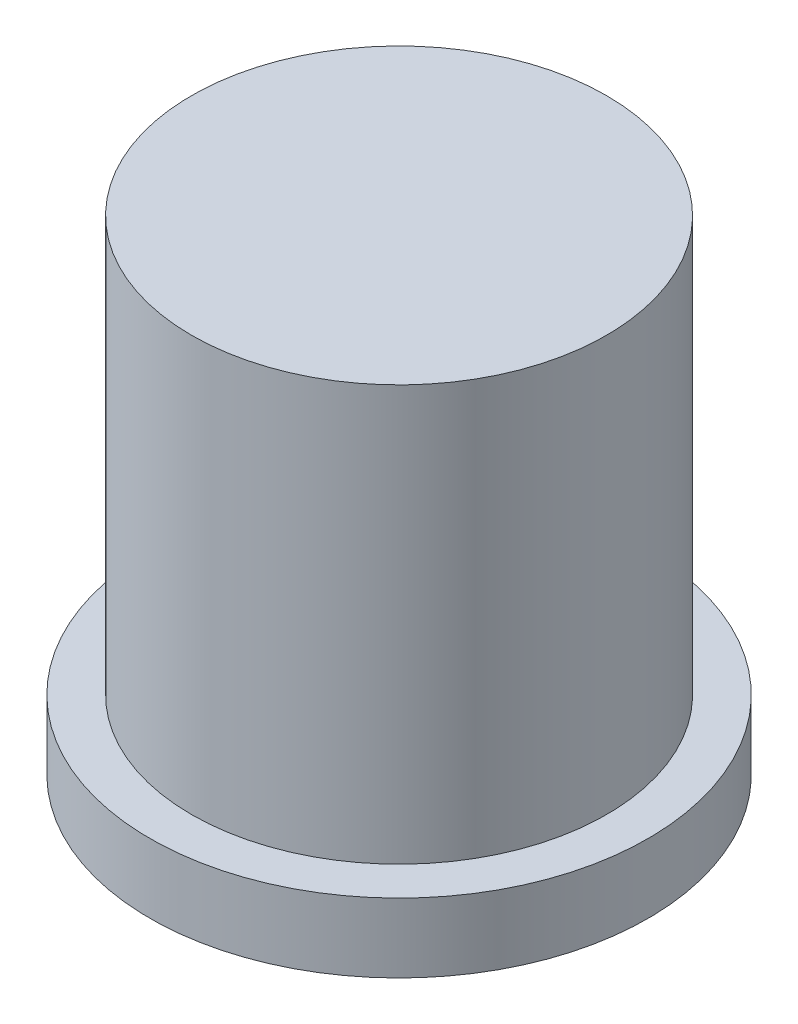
from build123d import *


with BuildPart() as part:
    # Sketch1 → Revolve1 (revolve)
    with BuildSketch(Plane.XY, mode=Mode.PRIVATE) as revolve1_sk:
        Polygon((0, 0), (-11.43, 0), (-11.43, 3.175), (-9.525, 3.175), (-9.525, 22.225), (0, 22.225), align=None)
    revolve(revolve1_sk.sketch.rotate(Axis((0, 0, 0), (0, 1, 0)), 270), axis=Axis((0, 0, 0), (0, 1, 0)))


solid = part.part
